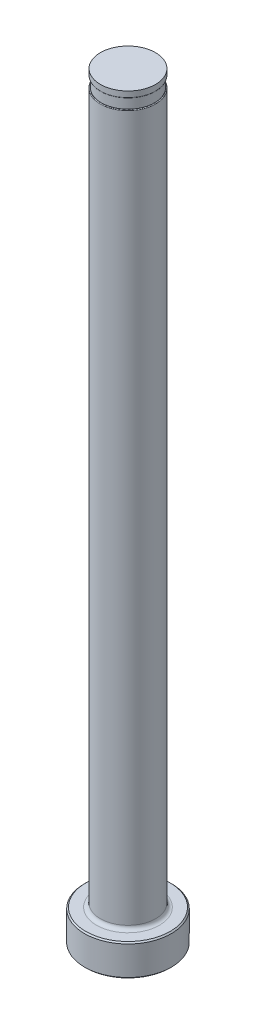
from build123d import *

# Parameters (mm, degrees)
CHAMFER1_SIZE     = 0.254
FILLET1_R         = 0.762
SKETCH2_W         = 0.2032
SKETCH2_H         = 2.032
D_SLOT_DEPTH      = 153.898684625
D_SLOT_DEPTH_BACK = 153.898684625
SKETCH5_W         = 0.0127
SKETCH5_H         = 1.27
FILLET2_R         = 0.127


with BuildPart() as part:
    # Sketch1 → Revolve1 (revolve)
    with BuildSketch(Plane.XY, mode=Mode.PRIVATE) as revolve1_sk:
        Polygon((0, 0), (-8.7249, 0), (-8.7249, 6.35), (-5.55625, 6.35), (-5.55625, 152.4), (0, 152.4), align=None)
    revolve(revolve1_sk.sketch.rotate(Axis((0, 259.958771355, 0), (0, -1, 0)), 270), axis=Axis((0, 259.958771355, 0), (0, -1, 0)))

    # Chamfer1
    chamfer1_edges = [part.edges().sort_by_distance(p)[0] for p in [
        (0, 6.35, -8.7249),
        (0, 0, -8.7249),
    ]]
    chamfer(chamfer1_edges, length=CHAMFER1_SIZE)

    # Fillet1
    fillet1_edges = [part.edges().sort_by_distance(p)[0] for p in [
        (0, 6.35, -5.55625),
    ]]
    fillet(fillet1_edges, radius=FILLET1_R)

    # Sketch2 → Vent Relief (revolve, cut)
    with BuildSketch(Plane.XY, mode=Mode.PRIVATE) as vent_relief_sk:
        with Locations((-5.45465, 150.114)):
            Rectangle(SKETCH2_W, SKETCH2_H)
    revolve(vent_relief_sk.sketch.rotate(Axis((0, 153.448281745, 0), (0, -1, 0)), 270), axis=Axis((0, 153.448281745, 0), (0, -1, 0)), mode=Mode.SUBTRACT)

    # Sketch3 → D-Slot (cut, two sides: drawn at the far end of the back side and taken through both)
    with BuildSketch(Plane.XY.offset(-D_SLOT_DEPTH_BACK)):
        with BuildLine():
            Line((-5.35305, 150.114), (-5.35305, 86.614))
            ThreePointArc((-5.35305, 86.614), (-5.404263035, 86.046038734), (-5.55625, 85.4964))
            Line((-5.55625, 85.4964), (-5.55625, 150.114))
            Line((-5.55625, 150.114), (-5.35305, 150.114))
        make_face()
    extrude(amount=D_SLOT_DEPTH + D_SLOT_DEPTH_BACK, mode=Mode.SUBTRACT)

    # Sketch5 → Vent Diameter (revolve, cut)
    with BuildSketch(Plane.XY, mode=Mode.PRIVATE) as vent_diameter_sk:
        with Locations((-5.5499, 151.765)):
            Rectangle(SKETCH5_W, SKETCH5_H)
    revolve(vent_diameter_sk.sketch.rotate(Axis((0, 152.687735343, 0), (0, -1, 0)), 90), axis=Axis((0, 152.687735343, 0), (0, -1, 0)), mode=Mode.SUBTRACT)

    # Fillet2
    fillet2_edges = [part.edges().sort_by_distance(p)[0] for p in [
        (4.424054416, 149.098, -3.361496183),
        (0, 151.13, 5.54355),
    ]]
    fillet(fillet2_edges, radius=FILLET2_R)


solid = part.part
